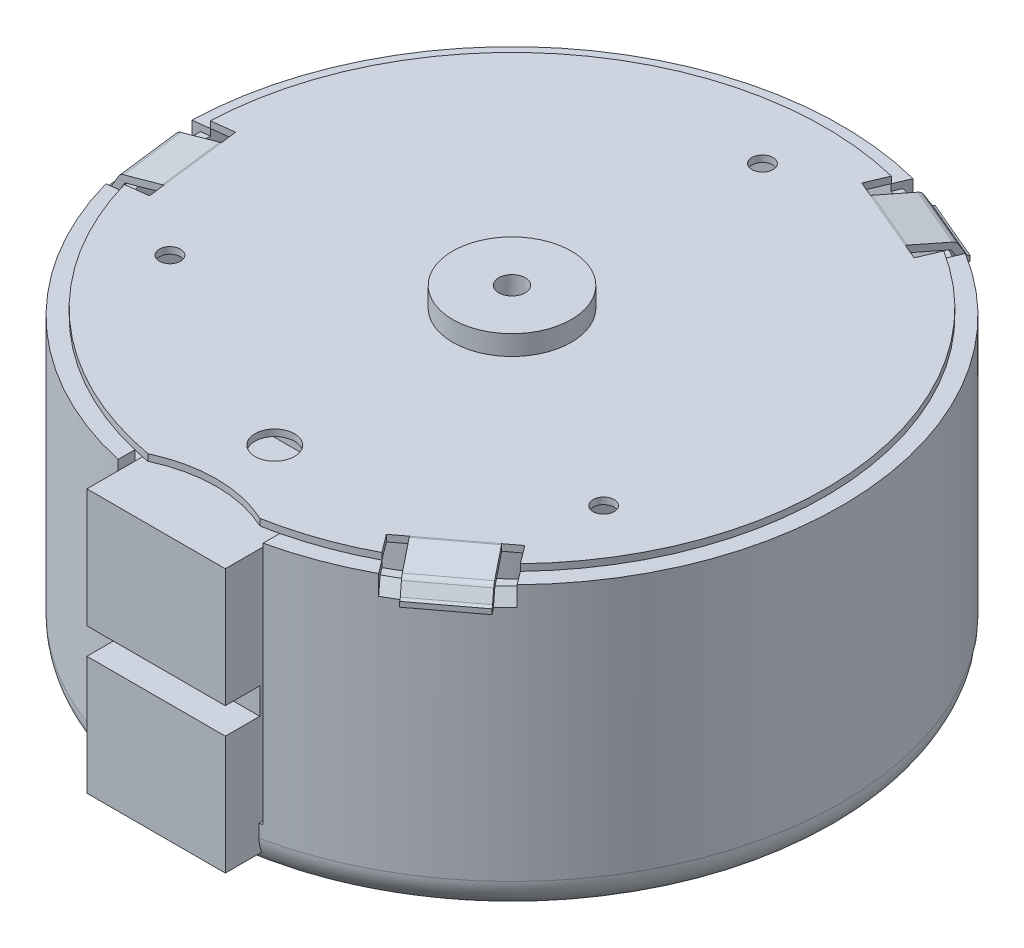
from build123d import *

# Parameters (mm, degrees)
ESQUISSE1_R                  = 25
BASE_EXTRUSION_DEPTH         = 22
CONG_1_R                     = 2.5
ESQUISSE2_R                  = 23.75
ESQUISSE2_R_2                = 15
ENL_V_MAT_EXTRU_1_DEPTH      = 10
ENL_V_MAT_EXTRU_2_DEPTH      = 0.5
CHANFREIN1_SIZE              = 1
CHANFREIN1_SIZE2             = 0.577350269
ESQUISSE4_R                  = 1.5
BOSS_EXTRU_1_DEPTH           = 0.5
BOSS_EXTRU_2_DEPTH           = 2.5
R_P_TITION_CIRCULAIRE1_COUNT = 3
ESQUISSE6_R                  = 4.5
ESQUISSE6_R_2                = 1
BOSS_EXTRU_3_DEPTH           = 1.5
ESQUISSE7_R                  = 0.8
ENL_V_MAT_EXTRU_3_DEPTH      = 3.5
ESQUISSE8_R                  = 21.5
ENL_V_MAT_EXTRU_4_DEPTH      = 0.1
BOSS_EXTRU_4_START           = 2
ESQUISSE9_R                  = 4.5
ESQUISSE9_R_2                = 2.5
BOSS_EXTRU_4_DEPTH           = 2
ESQUISSE10_R                 = 1
ENL_V_MAT_EXTRU_5_DEPTH      = 1.5
D_ME1_FACE_RADIUS            = 1
D_ME1_HEIGHT                 = 1
ENL_V_MAT_EXTRU_7_DEPTH      = 18
ESQUISSE13_W                 = 10.5
ESQUISSE13_H                 = 10.5
BOSS_EXTRU_5_DEPTH           = 20
ESQUISSE14_W                 = 10.5
ESQUISSE14_H                 = 2
ENL_V_MAT_EXTRU_9_DEPTH      = 2.612503


with BuildPart() as part:
    # Esquisse1 → Base-Extrusion (new body)
    with BuildSketch(Plane(origin=(0, 0, 0), x_dir=(1, 0, 0), z_dir=(0, 1, 0))):
        with Locations(Location((0, 0, 0), (0, 0, 270))):
            Circle(ESQUISSE1_R)
    extrude(amount=-BASE_EXTRUSION_DEPTH)

    # Cong_1
    cong_1_edges = [part.edges().sort_by_distance(p)[0] for p in [
        (0, -22, -25),
    ]]
    fillet(cong_1_edges, radius=CONG_1_R)

    # Esquisse2 → Enl_v. mat.-Extru.1 (cut)
    with BuildSketch(Plane(origin=(0, 0, 0), x_dir=(-1, 0, 0), z_dir=(0, 1, 0))):
        with Locations(Location((0, 0, 0), (0, 0, 90))):
            Circle(ESQUISSE2_R)
        with Locations(Location((0, 0, 0), (0, 0, 90))):
            Circle(ESQUISSE2_R_2, mode=Mode.SUBTRACT)
    extrude(amount=-ENL_V_MAT_EXTRU_1_DEPTH, mode=Mode.SUBTRACT)

    # Esquisse3 → Enl_v. mat.-Extru.2 (cut)
    with BuildSketch(Plane(origin=(0, 0, 0), x_dir=(-1, 0, 0), z_dir=(0, 1, 0))):
        with BuildLine():
            Line((-6.20586668, -24.217498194), (-5.711564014, -23.05299409))
            ThreePointArc((-5.711564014, -23.05299409), (-9.279864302, -21.861990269), (-12.615350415, -20.122510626))
            Line((-12.615350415, -20.122510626), (-13.10965308, -21.28701473))
            ThreePointArc((-13.10965308, -21.28701473), (-9.768278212, -23.012621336), (-6.20586668, -24.217498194))
        make_face()
        with BuildLine():
            Line((-11.880268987, 21.996799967), (-11.118930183, 20.98646925))
            ThreePointArc((-11.118930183, 20.98646925), (-14.2931068, 18.967593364), (-17.108696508, 16.472856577))
            Line((-17.108696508, 16.472856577), (-17.870035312, 17.483187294))
            ThreePointArc((-17.870035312, 17.483187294), (-15.045375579, 19.965887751), (-11.880268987, 21.996799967))
        make_face()
        with BuildLine():
            Line((24.989922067, -0.709785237), (23.734280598, -0.863958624))
            ThreePointArc((23.734280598, -0.863958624), (23.572971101, 2.894396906), (22.820260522, 6.580137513))
            Line((22.820260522, 6.580137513), (24.075901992, 6.7343109))
            ThreePointArc((24.075901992, 6.7343109), (24.813653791, 3.046733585), (24.989922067, -0.709785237))
        make_face()
        with BuildLine():
            Line((5.5, 23.104382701), (5.5, 24.387496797))
            ThreePointArc((5.5, 24.387496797), (0, 25), (-5.5, 24.387496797))
            Line((-5.5, 24.387496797), (-5.5, 23.104382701))
            ThreePointArc((-5.5, 23.104382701), (0, 23.75), (5.5, 23.104382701))
        make_face()
    extrude(amount=-ENL_V_MAT_EXTRU_2_DEPTH, mode=Mode.SUBTRACT)

    # Chanfrein1
    chanfrein1_edges = [part.edges().sort_by_distance(p)[0] for p in [
        (9.768278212, -0.5, -23.012621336),
        (15.045375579, -0.5, 19.965887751),
        (-24.813653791, -0.5, 3.046733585),
    ]]
    chanfrein1_side = [part.faces().sort_by_distance(p)[0] for p in [
        (0, -9.75, -25),
    ]]
    chamfer(chanfrein1_edges, length=CHANFREIN1_SIZE, length2=CHANFREIN1_SIZE2, reference=chanfrein1_side[0])

    # Esquisse4 → Boss.-Extru.1 (add)
    with BuildSketch(Plane(origin=(0, 0, 0), x_dir=(-1, 0, 0), z_dir=(0, 1, 0))):
        with BuildLine():
            Line((-5.71552094, -23.062316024), (-5.046508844, -21.486222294))
            Line((-5.046508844, -21.486222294), (-11.950295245, -18.555738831))
            Line((-11.950295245, -18.555738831), (-12.619307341, -20.13183256))
            ThreePointArc((-12.619307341, -20.13183256), (-23.582896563, -2.895615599), (-17.114791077, 16.480944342))
            Line((-17.114791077, 16.480944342), (-16.084359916, 15.113516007))
            Line((-16.084359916, 15.113516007), (-10.094593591, 19.62712868))
            Line((-10.094593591, 19.62712868), (-11.125024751, 20.994557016))
            ThreePointArc((-11.125024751, 20.994557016), (-7.779243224, 22.450411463), (-4.25, 23.376806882))
            ThreePointArc((-4.25, 23.376806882), (0, 22.428740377), (4.25, 23.376806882))
            ThreePointArc((4.25, 23.376806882), (15.93290575, 17.62612023), (22.830312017, 6.581371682))
            Line((22.830312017, 6.581371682), (21.13086876, 6.372706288))
            Line((21.13086876, 6.372706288), (22.044888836, -1.07138985))
            Line((22.044888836, -1.07138985), (23.744332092, -0.862724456))
            ThreePointArc((23.744332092, -0.862724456), (14.29912495, -18.975579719), (-5.71552094, -23.062316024))
        make_face()
        with Locations(Location((0, 18, 0), (0, 0, 90))):
            Circle(ESQUISSE4_R, mode=Mode.SUBTRACT)
    extrude(amount=BOSS_EXTRU_1_DEPTH)

    # Esquisse5 → Boss.-Extru.2 (add, symmetric)
    with BuildSketch(Plane(origin=(0, 0, 0), x_dir=(0.39073112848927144, 0, -0.9205048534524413), z_dir=(0.9205048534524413, 0, 0.39073112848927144))):
        with BuildLine():
            Line((21.75, 0), (24.39955572, -0.5))
            Line((24.39955572, -0.5), (24.884529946, -1.34))
            ThreePointArc((24.884529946, -1.34), (25.030940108, -1.486410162), (25.230940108, -1.54))
            Line((25.230940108, -1.54), (25.501141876, -1.54))
            Line((25.501141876, -1.54), (25.501141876, -1.158003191))
            ThreePointArc((25.501141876, -1.158003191), (25.376141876, -1.124509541), (25.284635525, -1.033003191))
            Line((25.284635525, -1.033003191), (24.832568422, -0.25))
            ThreePointArc((24.832568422, -0.25), (24.688793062, -0.092149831), (24.49227466, -0.008672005))
            Line((24.49227466, -0.008672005), (21.84271894, 0.491327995))
            ThreePointArc((21.84271894, 0.491327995), (21.796561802, 0.497827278), (21.75, 0.5))
            Line((21.75, 0.5), (21.75, 0))
        make_face()
    boss_extru_2 = extrude(amount=BOSS_EXTRU_2_DEPTH, both=True)

    # R_p_tition circulaire1: Boss.-Extru.2 ×3 about axis
    r_p_tition_circulaire1_axis = Axis((0, 0, 0), (0, 1, 0))
    for i in range(1, R_P_TITION_CIRCULAIRE1_COUNT):
        add(boss_extru_2.rotate(r_p_tition_circulaire1_axis, i * 360 / R_P_TITION_CIRCULAIRE1_COUNT))

    # Esquisse6 → Boss.-Extru.3 (add)
    with BuildSketch(Plane(origin=(0, 0.5, 0), x_dir=(-1, 0, 0), z_dir=(0, 1, 0))):
        with Locations(Location((0, 0, 0), (0, 0, 90))):
            Circle(ESQUISSE6_R)
        with Locations(Location((0, 0, 0), (0, 0, 90))):
            Circle(ESQUISSE6_R_2, mode=Mode.SUBTRACT)
    extrude(amount=BOSS_EXTRU_3_DEPTH)

    # Esquisse7 → Enl_v. mat.-Extru.3 (cut)
    with BuildSketch(Plane(origin=(0, 0.5, 0), x_dir=(-1, 0, 0), z_dir=(0, 1, 0))):
        with Locations(Location((0, -19, 0), (0, 0, 90))):
            Circle(ESQUISSE7_R)
        with Locations(Location((-16.454482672, 9.5, 0), (0, 0, 90))):
            Circle(ESQUISSE7_R)
        with Locations(Location((16.454482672, 9.5, 0), (0, 0, 90))):
            Circle(ESQUISSE7_R)
    extrude(amount=-ENL_V_MAT_EXTRU_3_DEPTH, mode=Mode.SUBTRACT)

    # Esquisse8 → Enl_v. mat.-Extru.4 (cut)
    with BuildSketch(Plane.XZ.offset(22)):
        with Locations(Location((0, 0, 0), (0, 0, 270))):
            Circle(ESQUISSE8_R)
    extrude(amount=-ENL_V_MAT_EXTRU_4_DEPTH, mode=Mode.SUBTRACT)

    # Esquisse9 → Boss.-Extru.4 (add)
    with BuildSketch(Plane.XZ.offset(21.9).offset(BOSS_EXTRU_4_START)):
        with Locations(Location((0, 0, 0), (0, 0, 90))):
            Circle(ESQUISSE9_R)
        with Locations(Location((0, 0, 0), (0, 0, 270))):
            Circle(ESQUISSE9_R_2, mode=Mode.SUBTRACT)
    extrude(amount=-BOSS_EXTRU_4_DEPTH)

    # Esquisse10 → Enl_v. mat.-Extru.5 (cut)
    with BuildSketch(Plane.XZ.offset(21.9)):
        with Locations(Location((0, 0, 0), (0, 0, 90))):
            Circle(ESQUISSE10_R)
    extrude(amount=-ENL_V_MAT_EXTRU_5_DEPTH, mode=Mode.SUBTRACT)

    # D_me1: a dome of height H over a round flat face of radius A is a cap of a sphere of radius (A * A + H * H) / (2 * H)
    d_me1_r = (D_ME1_FACE_RADIUS * D_ME1_FACE_RADIUS + D_ME1_HEIGHT * D_ME1_HEIGHT) / (2 * D_ME1_HEIGHT)
    d_me1_base = Plane((0, -20.4, 0), z_dir=(0, -1, 0))
    with Locations(d_me1_base.offset(D_ME1_HEIGHT - d_me1_r)):
        d_me1_ball = Sphere(d_me1_r, mode=Mode.PRIVATE)
    add(split(d_me1_ball, bisect_by=d_me1_base, keep=Keep.TOP, mode=Mode.PRIVATE))

    # Esquisse12 → Enl_v. mat.-Extru.7 (cut)
    with BuildSketch(Plane(origin=(0, -0.5, 0), x_dir=(-1, 0, 0), z_dir=(0, 1, 0))):
        with BuildLine():
            Line((5.5, 23.104382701), (5.5, 24.387496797))
            ThreePointArc((5.5, 24.387496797), (0, 25), (-5.5, 24.387496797))
            Line((-5.5, 24.387496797), (-5.5, 23.104382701))
            ThreePointArc((-5.5, 23.104382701), (0, 23.75), (5.5, 23.104382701))
        make_face()
    extrude(amount=-ENL_V_MAT_EXTRU_7_DEPTH, mode=Mode.SUBTRACT)

    # Esquisse13 → Boss.-Extru.5 (add)
    with BuildSketch(Plane(origin=(0, -0.5, 0), x_dir=(-1, 0, 0), z_dir=(0, 1, 0))):
        with Locations((0, 21.75)):
            Rectangle(ESQUISSE13_W, ESQUISSE13_H)
    extrude(amount=-BOSS_EXTRU_5_DEPTH)

    # Esquisse14 → Enl_v. mat.-Extru.9 (cut)
    with BuildSketch(Plane.XY.offset(27)):
        with Locations((0, -10.5)):
            Rectangle(ESQUISSE14_W, ESQUISSE14_H)
    extrude(amount=-ENL_V_MAT_EXTRU_9_DEPTH, mode=Mode.SUBTRACT)


solid = part.part
